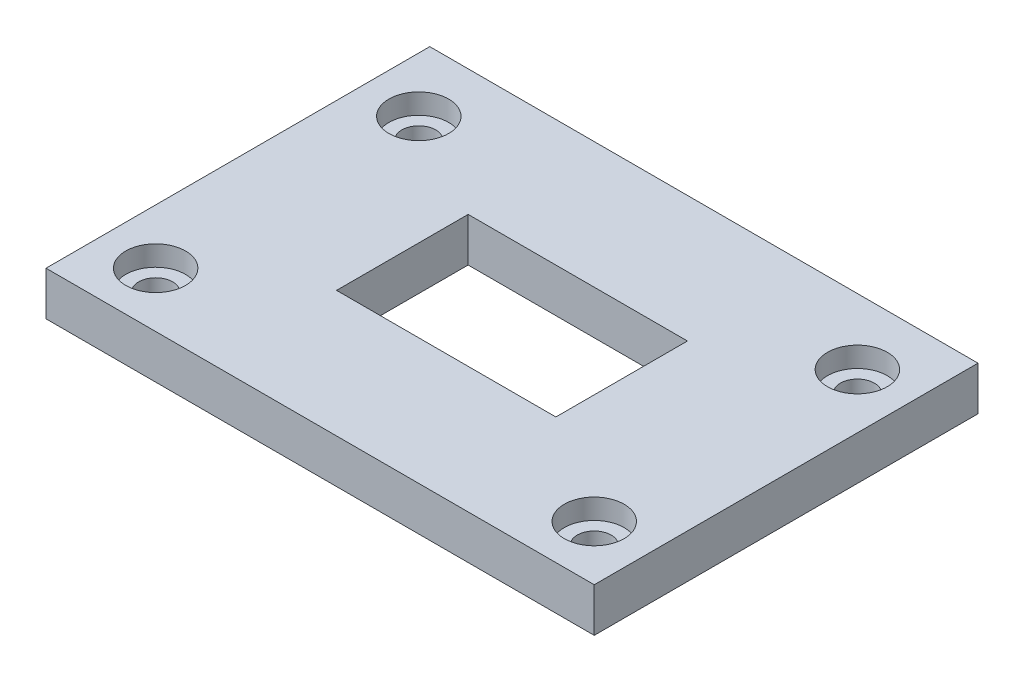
from build123d import *

# Parameters (mm, degrees)
SKETCH1_W                                = 250
SKETCH1_H                                = 175
EXTRUDE1_DEPTH                           = 20
CBORE_FOR_M14_HEX_HEAD_BOLT1_D           = 15.5
CBORE_FOR_M14_HEX_HEAD_BOLT1_CBORE_D     = 27.25
CBORE_FOR_M14_HEX_HEAD_BOLT1_CBORE_DEPTH = 9.25
SKETCH4_W                                = 100
SKETCH4_H                                = 60
CUT_EXTRUDE1_DEPTH                       = 154.887133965


with BuildPart() as part:
    # Sketch1 → Extrude1 (new body)
    with BuildSketch(Plane(origin=(0, 0, 0), x_dir=(1, 0, 0), z_dir=(0, 1, 0))):
        Rectangle(SKETCH1_W, SKETCH1_H)
    extrude(amount=EXTRUDE1_DEPTH)

    # CBORE for M14 Hex Head Bolt1 (through all)
    with Locations(Plane(origin=(0, 20, 0), x_dir=(-1, 0, 0), z_dir=(0, 1, 0))):
        with Locations((100, 62.5), (100, -57.5), (-100, 62.5), (-100, -57.5)):
            CounterBoreHole(CBORE_FOR_M14_HEX_HEAD_BOLT1_D / 2, CBORE_FOR_M14_HEX_HEAD_BOLT1_CBORE_D / 2, CBORE_FOR_M14_HEX_HEAD_BOLT1_CBORE_DEPTH)

    # Sketch4 → Cut-Extrude1 (cut, through all)
    with BuildSketch(Plane(origin=(0, 20, 0), x_dir=(-1, 0, 0), z_dir=(0, 1, 0))):
        Rectangle(SKETCH4_W, SKETCH4_H)
    extrude(amount=-CUT_EXTRUDE1_DEPTH, mode=Mode.SUBTRACT)


solid = part.part
